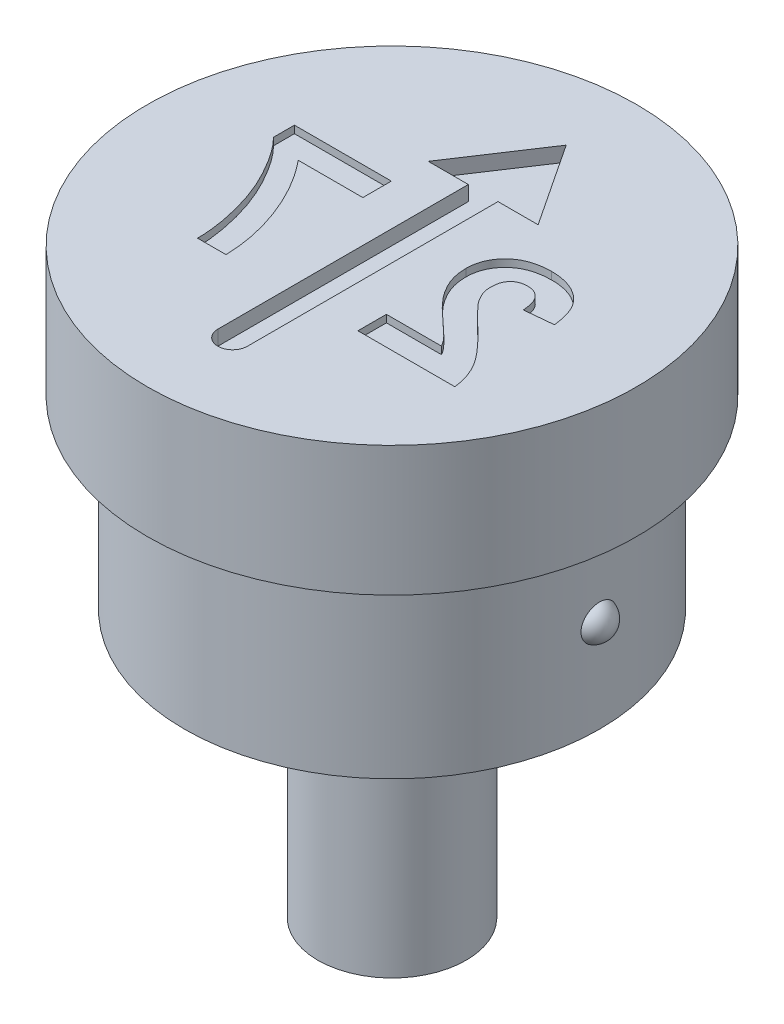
from build123d import *

# Parameters (mm, degrees)
CUT_EXTRUDE1_DEPTH = 0.4
CUT_EXTRUDE2_DEPTH = 0.2


with BuildPart() as part:
    # Sketch1 → Revolve1 (revolve)
    with BuildSketch(Plane.XY, mode=Mode.PRIVATE) as revolve1_sk:
        Polygon((0, 0), (-6.6, 0), (-6.6, -3.5), (-5.6, -3.5), (-5.6, -8.5), (-2, -8.5), (-2, -15.7), (0, -15.7), align=None)
    revolve(revolve1_sk.sketch.rotate(Axis((0, 0, 0), (0, -1, 0)), 270), axis=Axis((0, 0, 0), (0, -1, 0)))

    # Sketch3 → Cut-Extrude1 (cut)
    with BuildSketch(Plane(origin=(0, 0, 0), x_dir=(1, 0, 0), z_dir=(0, 1, 0))):
        with BuildLine():
            Line((0, 4.7), (-1.482623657, 2.46))
            Line((-1.482623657, 2.46), (-0.4, 2.46))
            Line((-0.4, 2.46), (-0.4, -4.3))
            ThreePointArc((-0.4, -4.3), (0, -4.7), (0.4, -4.3))
            Line((0.4, -4.3), (0.4, 2.46))
            Line((0.4, 2.46), (1.482623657, 2.46))
            Line((1.482623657, 2.46), (0, 4.7))
        make_face()
    extrude(amount=-CUT_EXTRUDE1_DEPTH, mode=Mode.SUBTRACT)

    # Sketch4 → Cut-Extrude2 (cut)
    with BuildSketch(Plane(origin=(0, 0, 0), x_dir=(1, 0, 0), z_dir=(0, 1, 0))):
        with BuildLine():
            Line((1.528524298, -1.679177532), (1.528524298, -2.448408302))
            Line((1.528524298, -2.448408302), (4.143908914, -2.448408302))
            add(Edge.make_bspline(
                [(4.143908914, -2.448408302), (4.135053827, -2.382666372), (4.11734862, -2.251219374), (4.062610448, -2.059208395), (3.989553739, -1.871838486), (3.910264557, -1.719364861), (3.831402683, -1.596628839), (3.759851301, -1.496057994), (3.674493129, -1.389054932), (3.576566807, -1.274755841), (3.466613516, -1.152803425), (3.343812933, -1.023651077), (3.207579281, -0.887917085), (3.11173648, -0.795747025), (3.062178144, -0.748087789)],
                knots=[0, 0, 0, 0, 1.156289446, 2.311930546, 3.473459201, 4.661751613, 5.303057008, 6.018253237, 6.81459331, 7.690699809, 8.644447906, 9.679642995, 10.800191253, 12, 12, 12, 12], degree=3))
            add(Edge.make_bspline(
                [(3.062178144, -0.748087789), (3.022630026, -0.709913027), (2.947342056, -0.637239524), (2.840131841, -0.533174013), (2.745883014, -0.437508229), (2.662624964, -0.352721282), (2.592281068, -0.276654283), (2.533926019, -0.21050185), (2.486820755, -0.153994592), (2.461308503, -0.118146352), (2.449998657, -0.102254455)],
                knots=[0, 0, 0, 0, 1.480720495, 2.818855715, 4.024636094, 5.098235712, 6.019786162, 6.815086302, 7.474715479, 8, 8, 8, 8], degree=3))
            add(Edge.make_bspline(
                [(2.449998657, -0.102254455), (2.426838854, -0.063783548), (2.382166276, 0.010422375), (2.333179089, 0.127112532), (2.303775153, 0.243778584), (2.299740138, 0.321734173), (2.297755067, 0.360085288)],
                knots=[0, 0, 0, 0, 1.0911822, 2.104764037, 3.067617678, 4, 4, 4, 4], degree=3))
            add(Edge.make_bspline(
                [(2.297755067, 0.360085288), (2.299195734, 0.39999478), (2.301921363, 0.475500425), (2.324776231, 0.582052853), (2.36530563, 0.673649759), (2.421107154, 0.750572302), (2.491668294, 0.81084082), (2.574156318, 0.855373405), (2.669778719, 0.87999412), (2.736987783, 0.883232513), (2.772114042, 0.884925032)],
                knots=[0, 0, 0, 0, 1.193122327, 2.257294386, 3.237245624, 4.168877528, 5.075331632, 5.990371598, 6.949684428, 8, 8, 8, 8], degree=3))
            add(Edge.make_bspline(
                [(2.772114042, 0.884925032), (2.80700299, 0.883344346), (2.874400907, 0.880290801), (2.970187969, 0.853615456), (3.05398397, 0.807437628), (3.113701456, 0.754813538), (3.154043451, 0.703640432), (3.181531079, 0.659046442), (3.205223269, 0.608373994), (3.226216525, 0.552193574), (3.242798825, 0.489861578), (3.256153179, 0.421852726), (3.266914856, 0.347801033), (3.270337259, 0.29628539), (3.272114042, 0.269540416)],
                knots=[0, 0, 0, 0, 1.402788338, 2.709884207, 3.961032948, 5.225417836, 5.883680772, 6.578928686, 7.329201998, 8.132101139, 8.990263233, 9.922304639, 10.921339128, 12, 12, 12, 12], degree=3))
            Line((3.272114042, 0.269540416), (4.041344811, 0.344860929))
            add(Edge.make_bspline(
                [(4.041344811, 0.344860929), (4.035160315, 0.396793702), (4.023169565, 0.49748305), (3.993246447, 0.642107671), (3.955349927, 0.775530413), (3.90767335, 0.897503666), (3.852187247, 1.008803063), (3.786061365, 1.107758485), (3.711606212, 1.19546608), (3.628757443, 1.271879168), (3.538041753, 1.337240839), (3.442851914, 1.39558616), (3.34132765, 1.44344787), (3.234586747, 1.482893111), (3.122677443, 1.514417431), (3.005082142, 1.535260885), (2.882526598, 1.54992225), (2.798869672, 1.551026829), (2.756088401, 1.551591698)],
                knots=[0, 0, 0, 0, 1.270971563, 2.464210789, 3.586263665, 4.638946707, 5.643716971, 6.603612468, 7.52484387, 8.434700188, 9.336036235, 10.239171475, 11.145359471, 12.059630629, 13.003312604, 13.96741569, 14.960557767, 16, 16, 16, 16], degree=3))
            add(Edge.make_bspline(
                [(2.756088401, 1.551591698), (2.709579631, 1.550697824), (2.618997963, 1.548956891), (2.486764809, 1.534580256), (2.362541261, 1.50951251), (2.245241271, 1.476306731), (2.136069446, 1.431974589), (2.034116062, 1.378378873), (1.940985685, 1.313485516), (1.855290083, 1.24083343), (1.778685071, 1.160939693), (1.711586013, 1.075719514), (1.655370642, 0.985232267), (1.608197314, 0.890580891), (1.573171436, 0.790242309), (1.547650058, 0.685603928), (1.530728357, 0.576177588), (1.52926711, 0.50144188), (1.528524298, 0.463450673)],
                knots=[0, 0, 0, 0, 1.210756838, 2.35810096, 3.457354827, 4.507168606, 5.527358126, 6.519769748, 7.499700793, 8.476517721, 9.440526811, 10.376769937, 11.295256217, 12.209626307, 13.124630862, 14.055668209, 15.011616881, 16, 16, 16, 16], degree=3))
            add(Edge.make_bspline(
                [(1.528524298, 0.463450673), (1.529502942, 0.419848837), (1.531444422, 0.333349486), (1.550032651, 0.205477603), (1.578431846, 0.08055443), (1.620403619, -0.041725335), (1.6736061, -0.164294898), (1.742185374, -0.287429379), (1.821811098, -0.414842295), (1.884154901, -0.497220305), (1.916344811, -0.539754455)],
                knots=[0, 0, 0, 0, 0.953409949, 1.89141903, 2.821310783, 3.752688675, 4.715703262, 5.740811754, 6.833515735, 8, 8, 8, 8], degree=3))
            add(Edge.make_bspline(
                [(1.916344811, -0.539754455), (1.928511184, -0.555078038), (1.954568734, -0.587897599), (1.998899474, -0.638221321), (2.050274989, -0.69319069), (2.107969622, -0.753834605), (2.173889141, -0.818005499), (2.245661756, -0.888386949), (2.326445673, -0.96137871), (2.410118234, -1.038801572), (2.494154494, -1.114156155), (2.571395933, -1.185726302), (2.641556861, -1.249050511), (2.701369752, -1.307624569), (2.754352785, -1.357450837), (2.798596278, -1.40108435), (2.834928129, -1.437468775), (2.884991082, -1.494182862), (2.948690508, -1.570888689), (2.993505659, -1.644183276), (3.014902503, -1.679177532)],
                knots=[0, 0, 0, 0, 0.665555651, 1.425465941, 2.280616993, 3.225313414, 4.272635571, 5.410053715, 6.644756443, 7.976022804, 9.288331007, 10.484517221, 11.558462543, 12.503158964, 13.33222979, 14.032602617, 14.617328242, 15.080653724, 16.606167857, 18, 18, 18, 18], degree=3))
            Line((3.014902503, -1.679177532), (1.528524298, -1.679177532))
        make_face()
        with BuildLine():
            Line((-1.517629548, 0.731078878), (-1.517629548, 1.500309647))
            Line((-1.517629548, 1.500309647), (-4.133014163, 1.500309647))
            Line((-4.133014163, 1.500309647), (-4.133014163, 0.936207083))
            add(Edge.make_bspline(
                [(-4.133014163, 0.936207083), (-4.105730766, 0.908447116), (-4.049643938, 0.851380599), (-3.969305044, 0.757985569), (-3.887775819, 0.656635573), (-3.806761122, 0.545964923), (-3.723742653, 0.427721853), (-3.642368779, 0.299639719), (-3.559837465, 0.163380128), (-3.448724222, -0.029359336), (-3.318846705, -0.281136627), (-3.181443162, -0.594108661), (-3.064381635, -0.916692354), (-2.984223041, -1.191557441), (-2.930063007, -1.411861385), (-2.894677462, -1.572952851), (-2.864890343, -1.729510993), (-2.840658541, -1.881810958), (-2.822573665, -2.029922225), (-2.808283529, -2.173329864), (-2.801233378, -2.312383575), (-2.800193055, -2.403530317), (-2.79968083, -2.448408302)],
                knots=[0, 0, 0, 0, 0.628545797, 1.29210959, 1.98878689, 2.729126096, 3.507039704, 4.322017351, 5.179550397, 6.080149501, 7.915136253, 9.752312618, 11.597470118, 13.454141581, 14.373891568, 15.261584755, 16.117868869, 16.947726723, 17.752002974, 18.527724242, 19.275094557, 20, 20, 20, 20], degree=3))
            Line((-2.79968083, -2.448408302), (-2.030450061, -2.448408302))
            add(Edge.make_bspline(
                [(-2.030450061, -2.448408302), (-2.033022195, -2.380263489), (-2.038195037, -2.243216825), (-2.05754897, -2.037514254), (-2.087946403, -1.831045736), (-2.125702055, -1.623334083), (-2.175548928, -1.414884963), (-2.232439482, -1.204926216), (-2.301353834, -0.994579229), (-2.378604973, -0.784246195), (-2.46388617, -0.575924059), (-2.556830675, -0.37219669), (-2.657198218, -0.174335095), (-2.763683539, 0.018355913), (-2.87752544, 0.205256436), (-2.998809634, 0.386163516), (-3.125815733, 0.562385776), (-3.21662661, 0.674857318), (-3.262020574, 0.731078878)],
                knots=[0, 0, 0, 0, 0.943249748, 1.896978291, 2.856365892, 3.829648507, 4.816416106, 5.820376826, 6.838120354, 7.877341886, 8.919613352, 9.951365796, 10.974227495, 11.988073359, 12.996274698, 14.000568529, 15.000536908, 16, 16, 16, 16], degree=3))
            Line((-3.262020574, 0.731078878), (-1.517629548, 0.731078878))
        make_face()
    extrude(amount=-CUT_EXTRUDE2_DEPTH, mode=Mode.SUBTRACT)

    # Sketch5 → Revolve2 (revolve)
    with BuildSketch(Plane.XY):
        with BuildLine():
            Line((5.437297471, -5.5), (5.437297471, -6.5))
            ThreePointArc((5.437297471, -6.5), (5.937297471, -6), (5.437297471, -5.5))
        make_face()
    revolve(axis=Axis((5.437297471, -5.5, 0), (0, -1, 0)))


solid = part.part
